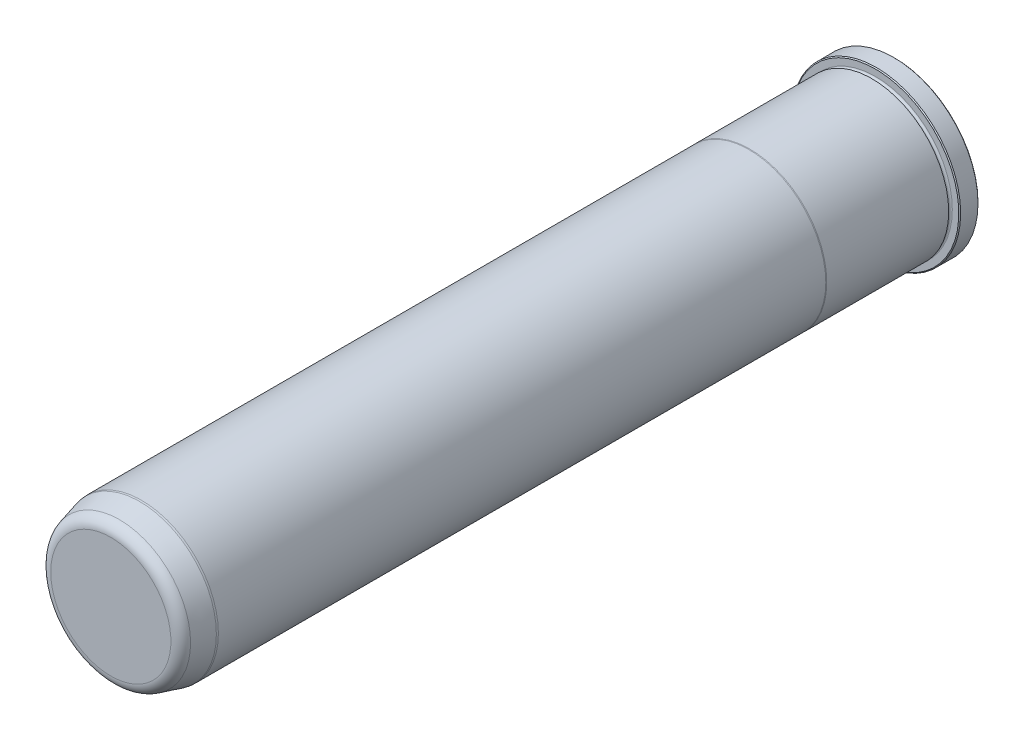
ISO-10303-21;
HEADER;
FILE_DESCRIPTION(('STEP AP214'),'2;1');
FILE_NAME('part.step','',(''),(''),'','','');
FILE_SCHEMA(('AUTOMOTIVE_DESIGN { 1 0 10303 214 1 1 1 1 }'));
ENDSEC;
DATA;
#1=APPLICATION_CONTEXT('core data for automotive mechanical design processes');
#2=APPLICATION_PROTOCOL_DEFINITION('international standard','automotive_design',2000,#1);
#3=PRODUCT_CONTEXT('',#1,'mechanical');
#4=PRODUCT('Part','Part','',(#3));
#5=PRODUCT_RELATED_PRODUCT_CATEGORY('part','',(#4));
#6=PRODUCT_DEFINITION_FORMATION('','',#4);
#7=PRODUCT_DEFINITION_CONTEXT('part definition',#1,'design');
#8=PRODUCT_DEFINITION('design','',#6,#7);
#9=PRODUCT_DEFINITION_SHAPE('','',#8);
#10=(LENGTH_UNIT() NAMED_UNIT(*) SI_UNIT(.MILLI.,.METRE.));
#11=(NAMED_UNIT(*) PLANE_ANGLE_UNIT() SI_UNIT($,.RADIAN.));
#12=(NAMED_UNIT(*) SI_UNIT($,.STERADIAN.) SOLID_ANGLE_UNIT());
#13=UNCERTAINTY_MEASURE_WITH_UNIT(LENGTH_MEASURE(1.E-05),#10,'distance_accuracy_value','');
#14=(GEOMETRIC_REPRESENTATION_CONTEXT(3) GLOBAL_UNCERTAINTY_ASSIGNED_CONTEXT((#13)) GLOBAL_UNIT_ASSIGNED_CONTEXT((#10,
#11,#12)) REPRESENTATION_CONTEXT('',''));
#15=CARTESIAN_POINT('',(0.,0.,0.));
#16=DIRECTION('',(0.,0.,1.));
#17=DIRECTION('',(1.,0.,0.));
#18=AXIS2_PLACEMENT_3D('',#15,#16,#17);
#19=CARTESIAN_POINT('',(0.,0.,0.));
#20=DIRECTION('',(0.,0.,1.));
#21=DIRECTION('',(1.,0.,0.));
#22=AXIS2_PLACEMENT_3D('',#19,#20,#21);
#23=PLANE('',#22);
#24=CARTESIAN_POINT('',(0.,0.,0.));
#25=DIRECTION('',(0.,0.,1.));
#26=DIRECTION('',(1.,0.,0.));
#27=AXIS2_PLACEMENT_3D('',#24,#25,#26);
#28=CIRCLE('',#27,34.417);
#29=CARTESIAN_POINT('',(34.417,0.,0.));
#30=VERTEX_POINT('',#29);
#31=EDGE_CURVE('E37',#30,#30,#28,.F.);
#32=ORIENTED_EDGE('',*,*,#31,.T.);
#33=EDGE_LOOP('',(#32));
#34=FACE_BOUND('',#33,.T.);
#35=ADVANCED_FACE('F30',(#34),#23,.F.);
#36=CARTESIAN_POINT('',(0.,0.,0.));
#37=DIRECTION('',(0.,0.,1.));
#38=DIRECTION('',(1.,0.,0.));
#39=AXIS2_PLACEMENT_3D('',#36,#37,#38);
#40=CYLINDRICAL_SURFACE('',#39,34.798);
#41=CARTESIAN_POINT('',(0.,0.,0.380999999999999));
#42=DIRECTION('',(0.,0.,1.));
#43=DIRECTION('',(1.,0.,0.));
#44=AXIS2_PLACEMENT_3D('',#41,#42,#43);
#45=CIRCLE('',#44,34.798);
#46=CARTESIAN_POINT('',(34.798,0.,0.380999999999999));
#47=VERTEX_POINT('',#46);
#48=EDGE_CURVE('E41',#47,#47,#45,.T.);
#49=ORIENTED_EDGE('',*,*,#48,.T.);
#50=EDGE_LOOP('',(#49));
#51=FACE_BOUND('',#50,.T.);
#52=CARTESIAN_POINT('',(0.,0.,7.5438));
#53=DIRECTION('',(0.,0.,-1.));
#54=DIRECTION('',(-1.,0.,0.));
#55=AXIS2_PLACEMENT_3D('',#52,#53,#54);
#56=CIRCLE('',#55,34.798);
#57=CARTESIAN_POINT('',(-34.798,0.,7.5438));
#58=VERTEX_POINT('',#57);
#59=EDGE_CURVE('E45',#58,#58,#56,.T.);
#60=ORIENTED_EDGE('',*,*,#59,.T.);
#61=EDGE_LOOP('',(#60));
#62=FACE_BOUND('',#61,.T.);
#63=ADVANCED_FACE('F118',(#51,#62),#40,.T.);
#64=CARTESIAN_POINT('',(0.,34.798,7.9248));
#65=DIRECTION('',(0.,0.,-1.));
#66=DIRECTION('',(-1.,0.,0.));
#67=AXIS2_PLACEMENT_3D('',#64,#65,#66);
#68=PLANE('',#67);
#69=CARTESIAN_POINT('',(0.,0.,7.9248));
#70=DIRECTION('',(0.,0.,-1.));
#71=DIRECTION('',(-1.,0.,0.));
#72=AXIS2_PLACEMENT_3D('',#69,#70,#71);
#73=CIRCLE('',#72,34.417);
#74=CARTESIAN_POINT('',(-34.417,0.,7.9248));
#75=VERTEX_POINT('',#74);
#76=EDGE_CURVE('E10',#75,#75,#73,.F.);
#77=ORIENTED_EDGE('',*,*,#76,.T.);
#78=EDGE_LOOP('',(#77));
#79=FACE_BOUND('',#78,.T.);
#80=CARTESIAN_POINT('',(0.,0.,7.9248));
#81=DIRECTION('',(0.,0.,1.));
#82=DIRECTION('',(1.,0.,0.));
#83=AXIS2_PLACEMENT_3D('',#80,#81,#82);
#84=CIRCLE('',#83,31.7373);
#85=CARTESIAN_POINT('',(31.7373,0.,7.9248));
#86=VERTEX_POINT('',#85);
#87=EDGE_CURVE('E56',#86,#86,#84,.T.);
#88=ORIENTED_EDGE('',*,*,#87,.F.);
#89=EDGE_LOOP('',(#88));
#90=FACE_BOUND('',#89,.T.);
#91=ADVANCED_FACE('F113',(#79,#90),#68,.F.);
#92=CARTESIAN_POINT('',(0.,0.,8.6868));
#93=DIRECTION('',(0.,0.,1.));
#94=DIRECTION('',(1.,0.,0.));
#95=AXIS2_PLACEMENT_3D('',#92,#93,#94);
#96=TOROIDAL_SURFACE('',#95,31.7373,0.761999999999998);
#97=CARTESIAN_POINT('',(0.,0.,9.44879999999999));
#98=DIRECTION('',(0.,0.,1.));
#99=DIRECTION('',(1.,0.,0.));
#100=AXIS2_PLACEMENT_3D('',#97,#98,#99);
#101=CIRCLE('',#100,31.7373);
#102=CARTESIAN_POINT('',(31.7373,0.,9.44879999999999));
#103=VERTEX_POINT('',#102);
#104=EDGE_CURVE('E59',#103,#103,#101,.T.);
#105=ORIENTED_EDGE('',*,*,#104,.F.);
#106=EDGE_LOOP('',(#105));
#107=FACE_BOUND('',#106,.T.);
#108=ORIENTED_EDGE('',*,*,#87,.T.);
#109=EDGE_LOOP('',(#108));
#110=FACE_BOUND('',#109,.T.);
#111=ADVANCED_FACE('F107',(#107,#110),#96,.F.);
#112=CARTESIAN_POINT('',(0.,31.7373,9.44879999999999));
#113=DIRECTION('',(0.,0.,1.));
#114=DIRECTION('',(1.,0.,0.));
#115=AXIS2_PLACEMENT_3D('',#112,#113,#114);
#116=PLANE('',#115);
#117=CARTESIAN_POINT('',(0.,0.,9.4488));
#118=DIRECTION('',(0.,0.,1.));
#119=DIRECTION('',(1.,0.,0.));
#120=AXIS2_PLACEMENT_3D('',#117,#118,#119);
#121=CIRCLE('',#120,31.7627);
#122=CARTESIAN_POINT('',(31.7627,0.,9.4488));
#123=VERTEX_POINT('',#122);
#124=EDGE_CURVE('E62',#123,#123,#121,.T.);
#125=ORIENTED_EDGE('',*,*,#124,.F.);
#126=EDGE_LOOP('',(#125));
#127=FACE_BOUND('',#126,.T.);
#128=ORIENTED_EDGE('',*,*,#104,.T.);
#129=EDGE_LOOP('',(#128));
#130=FACE_BOUND('',#129,.T.);
#131=ADVANCED_FACE('F101',(#127,#130),#116,.F.);
#132=CARTESIAN_POINT('',(0.,0.,0.));
#133=DIRECTION('',(0.,0.,1.));
#134=DIRECTION('',(1.,0.,0.));
#135=AXIS2_PLACEMENT_3D('',#132,#133,#134);
#136=CYLINDRICAL_SURFACE('',#135,31.7627);
#137=CARTESIAN_POINT('',(0.,0.,59.8347630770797));
#138=DIRECTION('',(0.,0.,1.));
#139=DIRECTION('',(1.,0.,0.));
#140=AXIS2_PLACEMENT_3D('',#137,#138,#139);
#141=CIRCLE('',#140,31.7627);
#142=CARTESIAN_POINT('',(31.7627,0.,59.8347630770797));
#143=VERTEX_POINT('',#142);
#144=EDGE_CURVE('E65',#143,#143,#141,.T.);
#145=ORIENTED_EDGE('',*,*,#144,.F.);
#146=EDGE_LOOP('',(#145));
#147=FACE_BOUND('',#146,.T.);
#148=ORIENTED_EDGE('',*,*,#124,.T.);
#149=EDGE_LOOP('',(#148));
#150=FACE_BOUND('',#149,.T.);
#151=ADVANCED_FACE('F95',(#147,#150),#136,.T.);
#152=CARTESIAN_POINT('',(0.,0.,59.8347630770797));
#153=DIRECTION('',(0.,0.,-1.));
#154=DIRECTION('',(-1.,0.,0.));
#155=AXIS2_PLACEMENT_3D('',#152,#153,#154);
#156=CONICAL_SURFACE('',#155,31.7627,0.0698131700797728);
#157=CARTESIAN_POINT('',(0.,0.,60.198));
#158=DIRECTION('',(0.,0.,1.));
#159=DIRECTION('',(1.,0.,0.));
#160=AXIS2_PLACEMENT_3D('',#157,#158,#159);
#161=CIRCLE('',#160,31.7373);
#162=CARTESIAN_POINT('',(31.7373,0.,60.198));
#163=VERTEX_POINT('',#162);
#164=EDGE_CURVE('E68',#163,#163,#161,.T.);
#165=ORIENTED_EDGE('',*,*,#164,.F.);
#166=EDGE_LOOP('',(#165));
#167=FACE_BOUND('',#166,.T.);
#168=ORIENTED_EDGE('',*,*,#144,.T.);
#169=EDGE_LOOP('',(#168));
#170=FACE_BOUND('',#169,.T.);
#171=ADVANCED_FACE('F89',(#167,#170),#156,.T.);
#172=CARTESIAN_POINT('',(0.,0.,0.));
#173=DIRECTION('',(0.,0.,1.));
#174=DIRECTION('',(1.,0.,0.));
#175=AXIS2_PLACEMENT_3D('',#172,#173,#174);
#176=CYLINDRICAL_SURFACE('',#175,31.7373);
#177=CARTESIAN_POINT('',(0.,0.,311.15));
#178=DIRECTION('',(0.,0.,1.));
#179=DIRECTION('',(1.,0.,0.));
#180=AXIS2_PLACEMENT_3D('',#177,#178,#179);
#181=CIRCLE('',#180,31.7373);
#182=CARTESIAN_POINT('',(31.7373,0.,311.15));
#183=VERTEX_POINT('',#182);
#184=EDGE_CURVE('E71',#183,#183,#181,.T.);
#185=ORIENTED_EDGE('',*,*,#184,.F.);
#186=EDGE_LOOP('',(#185));
#187=FACE_BOUND('',#186,.T.);
#188=ORIENTED_EDGE('',*,*,#164,.T.);
#189=EDGE_LOOP('',(#188));
#190=FACE_BOUND('',#189,.T.);
#191=ADVANCED_FACE('F83',(#187,#190),#176,.T.);
#192=CARTESIAN_POINT('',(0.,0.,311.15));
#193=DIRECTION('',(0.,0.,-1.));
#194=DIRECTION('',(-1.,0.,0.));
#195=AXIS2_PLACEMENT_3D('',#192,#193,#194);
#196=CONICAL_SURFACE('',#195,31.7373,0.0872664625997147);
#197=CARTESIAN_POINT('',(0.,0.,311.912));
#198=DIRECTION('',(0.,0.,1.));
#199=DIRECTION('',(1.,0.,0.));
#200=AXIS2_PLACEMENT_3D('',#197,#198,#199);
#201=CIRCLE('',#200,31.6706336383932);
#202=CARTESIAN_POINT('',(31.6706336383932,0.,311.912));
#203=VERTEX_POINT('',#202);
#204=EDGE_CURVE('E74',#203,#203,#201,.T.);
#205=ORIENTED_EDGE('',*,*,#204,.F.);
#206=EDGE_LOOP('',(#205));
#207=FACE_BOUND('',#206,.T.);
#208=ORIENTED_EDGE('',*,*,#184,.T.);
#209=EDGE_LOOP('',(#208));
#210=FACE_BOUND('',#209,.T.);
#211=ADVANCED_FACE('F80',(#207,#210),#196,.T.);
#212=CARTESIAN_POINT('',(0.,0.,311.912));
#213=DIRECTION('',(0.,0.,-1.));
#214=DIRECTION('',(-1.,0.,0.));
#215=AXIS2_PLACEMENT_3D('',#212,#213,#214);
#216=CONICAL_SURFACE('',#215,31.6706336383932,0.26179938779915);
#217=CARTESIAN_POINT('',(0.,0.,320.320125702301));
#218=DIRECTION('',(0.,0.,1.));
#219=DIRECTION('',(1.,0.,0.));
#220=AXIS2_PLACEMENT_3D('',#217,#218,#219);
#221=CIRCLE('',#220,29.4176831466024);
#222=CARTESIAN_POINT('',(29.4176831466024,0.,320.320125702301));
#223=VERTEX_POINT('',#222);
#224=EDGE_CURVE('E50',#223,#223,#221,.F.);
#225=ORIENTED_EDGE('',*,*,#224,.T.);
#226=EDGE_LOOP('',(#225));
#227=FACE_BOUND('',#226,.T.);
#228=ORIENTED_EDGE('',*,*,#204,.T.);
#229=EDGE_LOOP('',(#228));
#230=FACE_BOUND('',#229,.T.);
#231=ADVANCED_FACE('F78',(#227,#230),#216,.T.);
#232=CARTESIAN_POINT('',(0.,28.4718561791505,323.85));
#233=DIRECTION('',(0.,0.,-1.));
#234=DIRECTION('',(-1.,0.,0.));
#235=AXIS2_PLACEMENT_3D('',#232,#233,#234);
#236=PLANE('',#235);
#237=CARTESIAN_POINT('',(0.,0.,323.85));
#238=DIRECTION('',(0.,0.,-1.));
#239=DIRECTION('',(-1.,0.,0.));
#240=AXIS2_PLACEMENT_3D('',#237,#238,#239);
#241=CIRCLE('',#240,24.8174613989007);
#242=CARTESIAN_POINT('',(-24.8174613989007,0.,323.85));
#243=VERTEX_POINT('',#242);
#244=EDGE_CURVE('E53',#243,#243,#241,.F.);
#245=ORIENTED_EDGE('',*,*,#244,.T.);
#246=EDGE_LOOP('',(#245));
#247=FACE_BOUND('',#246,.T.);
#248=ADVANCED_FACE('F133',(#247),#236,.F.);
#249=CARTESIAN_POINT('',(0.,0.,319.0875));
#250=DIRECTION('',(0.,0.,-1.));
#251=DIRECTION('',(-1.,0.,0.));
#252=AXIS2_PLACEMENT_3D('',#249,#250,#251);
#253=TOROIDAL_SURFACE('',#252,24.8174613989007,4.7625);
#254=ORIENTED_EDGE('',*,*,#224,.F.);
#255=EDGE_LOOP('',(#254));
#256=FACE_BOUND('',#255,.T.);
#257=ORIENTED_EDGE('',*,*,#244,.F.);
#258=EDGE_LOOP('',(#257));
#259=FACE_BOUND('',#258,.T.);
#260=ADVANCED_FACE('F130',(#256,#259),#253,.T.);
#261=CARTESIAN_POINT('',(0.,0.,0.380999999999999));
#262=DIRECTION('',(0.,0.,1.));
#263=DIRECTION('',(1.,0.,0.));
#264=AXIS2_PLACEMENT_3D('',#261,#262,#263);
#265=CONICAL_SURFACE('',#264,34.798,0.785398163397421);
#266=ORIENTED_EDGE('',*,*,#31,.F.);
#267=EDGE_LOOP('',(#266));
#268=FACE_BOUND('',#267,.T.);
#269=ORIENTED_EDGE('',*,*,#48,.F.);
#270=EDGE_LOOP('',(#269));
#271=FACE_BOUND('',#270,.T.);
#272=ADVANCED_FACE('F132',(#268,#271),#265,.T.);
#273=CARTESIAN_POINT('',(0.,0.,7.9248));
#274=DIRECTION('',(0.,0.,-1.));
#275=DIRECTION('',(-1.,0.,0.));
#276=AXIS2_PLACEMENT_3D('',#273,#274,#275);
#277=CONICAL_SURFACE('',#276,34.417,0.785398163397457);
#278=ORIENTED_EDGE('',*,*,#59,.F.);
#279=EDGE_LOOP('',(#278));
#280=FACE_BOUND('',#279,.T.);
#281=ORIENTED_EDGE('',*,*,#76,.F.);
#282=EDGE_LOOP('',(#281));
#283=FACE_BOUND('',#282,.T.);
#284=ADVANCED_FACE('F32',(#280,#283),#277,.T.);
#285=CLOSED_SHELL('',(#35,#63,#91,#111,#131,#151,#171,#191,#211,#231,#248,#260,#272,#284));
#286=MANIFOLD_SOLID_BREP('B2',#285);
#287=ADVANCED_BREP_SHAPE_REPRESENTATION('',(#18,#286),#14);
#288=SHAPE_DEFINITION_REPRESENTATION(#9,#287);
ENDSEC;
END-ISO-10303-21;
